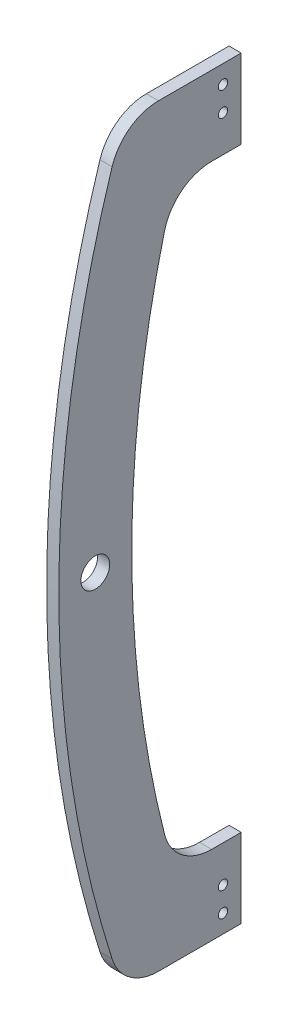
from build123d import *

# Parameters (mm, degrees)
BOSS_EXTRUDE1_DEPTH     = 12.7
SKETCH2_R               = 15.08125
CUT_EXTRUDE1_DEPTH      = 438.551402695
F_3_8_CLEARANCE_HOLE1_D = 9.8044


with BuildPart() as part:
    # Sketch1 → Boss-Extrude1 (new body)
    with BuildSketch(Plane(origin=(0, 0, 0), x_dir=(0, 0, -1), z_dir=(1, 0, 0))):
        with BuildLine():
            Line((-86.431884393, 393.7), (0, 393.7))
            Line((0, 393.7), (0, 311.15))
            Line((0, 311.15), (-30.842454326, 311.15))
            ThreePointArc((-30.842454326, 311.15), (-62.013378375, 300.462510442), (-80.068596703, 272.896987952))
            ThreePointArc((-80.068596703, 272.896987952), (-114.3, 0), (-80.068596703, -272.896987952))
            ThreePointArc((-80.068596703, -272.896987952), (-62.013378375, -300.462510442), (-30.842454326, -311.15))
            Line((-30.842454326, -311.15), (0, -311.15))
            Line((0, -311.15), (0, -393.7))
            Line((0, -393.7), (-86.431884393, -393.7))
            ThreePointArc((-86.431884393, -393.7), (-116.413121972, -383.909333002), (-134.837811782, -358.311235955))
            ThreePointArc((-134.837811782, -358.311235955), (-190.5, 0), (-134.837811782, 358.311235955))
            ThreePointArc((-134.837811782, 358.311235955), (-116.413121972, 383.909333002), (-86.431884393, 393.7))
        make_face()
    extrude(amount=BOSS_EXTRUDE1_DEPTH)

    # Sketch2 → Cut-Extrude1 (cut, through all)
    with BuildSketch(Plane(origin=(12.7, 0, 0), x_dir=(0, 0, -1), z_dir=(1, 0, 0))):
        with Locations((-152.4, 0)):
            Circle(SKETCH2_R)
    extrude(amount=-CUT_EXTRUDE1_DEPTH, mode=Mode.SUBTRACT)

    # 3_8 Clearance Hole1 (through all)
    with Locations(Plane(origin=(12.7, 0, 0), x_dir=(0, 0, -1), z_dir=(1, 0, 0))):
        with Locations((-19.05, -349.25), (-19.05, -374.65), (-19.05, 349.25), (-19.05, 374.65)):
            Hole(F_3_8_CLEARANCE_HOLE1_D / 2)


solid = part.part
